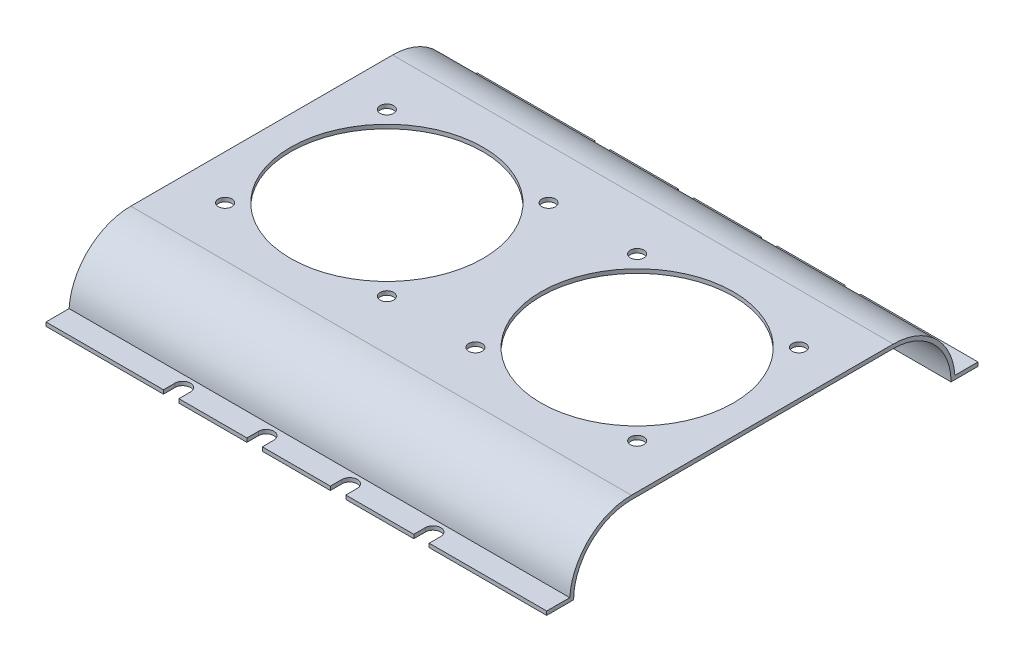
from build123d import *

# Parameters (mm, degrees)
AUFSATZ_LINEAR_AUSTRAGEN7_DEPTH  = 130
AUFSATZ_LINEAR_AUSTRAGEN8_DEPTH  = 130
AUFSATZ_LINEAR_AUSTRAGEN9_DEPTH  = 130
AUFSATZ_LINEAR_AUSTRAGEN10_DEPTH = 130
AUFSATZ_LINEAR_AUSTRAGEN11_DEPTH = 130
SKIZZE5_R                        = 25
SCHNITT_LINEAR_AUSTRAGEN1_DEPTH  = 12
SCHNITT_LINEAR_AUSTRAGEN2_DEPTH  = 2
SCHNITT_LINEAR_AUSTRAGEN4_DEPTH  = 2
SKIZZE9_R                        = 1.75
SCHNITT_LINEAR_AUSTRAGEN10_DEPTH = 2


with BuildPart() as part:
    # 3D-Skizze4 → Aufsatz-Linear austragen7 (new body)
    with BuildSketch(Plane(origin=(0, 1, 72.000262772), x_dir=(0, -0.16439898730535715, 0.9863939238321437), z_dir=(1, 0, 0))):
        Polygon((0, 0), (0.164398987, 0.986393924), (6.08276253, 0), (5.918363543, -0.986393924), align=None)
    extrude(amount=AUFSATZ_LINEAR_AUSTRAGEN7_DEPTH)

    # 3D-Skizze6 → Aufsatz-Linear austragen8 (add)
    with BuildSketch(Plane(origin=(0, 0, 72.031482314), x_dir=(0, 0.7071067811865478, -0.7071067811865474), z_dir=(-1, 0, 0))):
        with BuildLine():
            Line((0, 0), (0.729182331, 0.729182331))
            ThreePointArc((0.729182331, 0.729182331), (11.335784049, -3.664215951), (21.942385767, 0.729182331))
            Line((21.942385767, 0.729182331), (22.671568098, 0))
            ThreePointArc((22.671568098, 0), (11.335784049, -4.695435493), (0, 0))
        make_face()
    extrude(amount=-AUFSATZ_LINEAR_AUSTRAGEN8_DEPTH)

    # 3D-Skizze7 → Aufsatz-Linear austragen9 (add)
    with BuildSketch(Plane(origin=(0, 16.031219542, -11.999737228), x_dir=(0, -0.015163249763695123, 0.9998850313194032), z_dir=(1, 0, 0))):
        Polygon((0, 0), (0.015636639, 1.031100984), (68.007818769, 0), (67.99218213, -1.031100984), align=None)
    extrude(amount=AUFSATZ_LINEAR_AUSTRAGEN9_DEPTH)

    # 3D-Skizze8 → Aufsatz-Linear austragen10 (add)
    with BuildSketch(Plane(origin=(0, 0, -28.03095677), x_dir=(0, 0.7071067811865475, 0.7071067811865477), z_dir=(1, 0, 0))):
        with BuildLine():
            Line((0, 0), (0.736183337, 0.722185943))
            ThreePointArc((0.736183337, 0.722185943), (11.340732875, -3.664215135), (21.942385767, 0.729182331))
            Line((21.942385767, 0.729182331), (22.671568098, 0))
            ThreePointArc((22.671568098, 0), (11.335784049, -4.695435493), (0, 0))
        make_face()
    extrude(amount=AUFSATZ_LINEAR_AUSTRAGEN10_DEPTH)

    # 3D-Skizze9 → Aufsatz-Linear austragen11 (add)
    with BuildSketch(Plane(origin=(0, 1, -27.999737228), x_dir=(0, -0.16439898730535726, -0.9863939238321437), z_dir=(-1, 0, 0))):
        Polygon((0, 0), (0.164398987, 0.986393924), (6.08276253, 0), (5.918363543, -0.986393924), align=None)
    extrude(amount=-AUFSATZ_LINEAR_AUSTRAGEN11_DEPTH)

    # Skizze5 → Schnitt-Linear austragen1 (cut)
    with BuildSketch(Plane(origin=(0, 16.031219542, 0), x_dir=(1, 0, 0), z_dir=(0, 1, 0))):
        with Locations(Location((97.5, -22.000262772, 0), (0, 0, 270))):
            Circle(SKIZZE5_R)
        with Locations(Location((32.5, -22.000262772, 0), (0, 0, 270))):
            Circle(SKIZZE5_R)
    extrude(amount=-SCHNITT_LINEAR_AUSTRAGEN1_DEPTH, mode=Mode.SUBTRACT)

    # Skizze6 → Schnitt-Linear austragen2 (cut)
    with BuildSketch(Plane(origin=(0, 1, 0), x_dir=(1, 0, 0), z_dir=(0, 1, 0))):
        with BuildLine():
            Line((73.834, -75.000262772), (73.834, -78.000262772))
            Line((73.834, -78.000262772), (77.834, -78.000262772))
            Line((77.834, -78.000262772), (77.834, -75.000262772))
            ThreePointArc((77.834, -75.000262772), (75.834, -73.000262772), (73.834, -75.000262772))
        make_face()
        with BuildLine():
            Line((52.168, -75.000262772), (52.168, -78.000262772))
            Line((52.168, -78.000262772), (56.168, -78.000262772))
            Line((56.168, -78.000262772), (56.168, -75.000262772))
            ThreePointArc((56.168, -75.000262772), (54.168, -73.000262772), (52.168, -75.000262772))
        make_face()
        with BuildLine():
            Line((34.5, -75.000262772), (34.5, -78.000262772))
            Line((34.5, -78.000262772), (30.5, -78.000262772))
            Line((30.5, -78.000262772), (30.5, -75.000262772))
            ThreePointArc((30.5, -75.000262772), (32.5, -73.000262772), (34.5, -75.000262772))
        make_face()
        with BuildLine():
            Line((95.5, -75.000262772), (95.5, -78.000262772))
            Line((95.5, -78.000262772), (99.5, -78.000262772))
            Line((99.5, -78.000262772), (99.5, -75.000262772))
            ThreePointArc((99.5, -75.000262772), (97.5, -73.000262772), (95.5, -75.000262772))
        make_face()
    extrude(amount=-SCHNITT_LINEAR_AUSTRAGEN2_DEPTH, mode=Mode.SUBTRACT)

    # Skizze8 → Schnitt-Linear austragen4 (cut)
    with BuildSketch(Plane(origin=(0, 1, 0), x_dir=(1, 0, 0), z_dir=(0, 1, 0))):
        with BuildLine():
            Line((99.5, 30.999737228), (99.5, 33.999737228))
            Line((99.5, 33.999737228), (95.5, 33.999737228))
            Line((95.5, 33.999737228), (95.5, 30.999737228))
            ThreePointArc((95.5, 30.999737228), (97.5, 28.999737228), (99.5, 30.999737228))
        make_face()
        with BuildLine():
            Line((77.834, 30.999737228), (77.834, 33.999737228))
            Line((77.834, 33.999737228), (73.834, 33.999737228))
            Line((73.834, 33.999737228), (73.834, 30.999737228))
            ThreePointArc((73.834, 30.999737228), (75.834, 28.999737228), (77.834, 30.999737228))
        make_face()
        with BuildLine():
            Line((56.168, 30.999737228), (56.168, 33.999737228))
            Line((56.168, 33.999737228), (52.168, 33.999737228))
            Line((52.168, 33.999737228), (52.168, 30.999737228))
            ThreePointArc((52.168, 30.999737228), (54.168, 28.999737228), (56.168, 30.999737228))
        make_face()
        with BuildLine():
            Line((34.5, 30.999737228), (34.5, 33.999737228))
            Line((34.5, 33.999737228), (30.5, 33.999737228))
            Line((30.5, 33.999737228), (30.5, 30.999737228))
            ThreePointArc((30.5, 30.999737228), (32.5, 28.999737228), (34.5, 30.999737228))
        make_face()
    extrude(amount=-SCHNITT_LINEAR_AUSTRAGEN4_DEPTH, mode=Mode.SUBTRACT)

    # Skizze9 → Schnitt-Linear austragen10 (cut)
    with BuildSketch(Plane(origin=(0, 16.031219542, 0), x_dir=(1, 0, 0), z_dir=(0, 1, 0))):
        with Locations(Location((11.498928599, -0.99919137, 0), (0, 0, 270))):
            Circle(SKIZZE9_R)
        with Locations(Location((53.501071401, -0.99919137, 0), (0, 0, 270))):
            Circle(SKIZZE9_R)
        with Locations(Location((76.498928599, -0.99919137, 0), (0, 0, 270))):
            Circle(SKIZZE9_R)
        with Locations(Location((118.501071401, -0.99919137, 0), (0, 0, 270))):
            Circle(SKIZZE9_R)
        with Locations(Location((118.501071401, -43.001334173, 0), (0, 0, 270))):
            Circle(SKIZZE9_R)
        with Locations(Location((76.498928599, -43.001334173, 0), (0, 0, 270))):
            Circle(SKIZZE9_R)
        with Locations(Location((53.501071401, -43.001334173, 0), (0, 0, 270))):
            Circle(SKIZZE9_R)
        with Locations(Location((11.498928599, -43.001334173, 0), (0, 0, 270))):
            Circle(SKIZZE9_R)
    extrude(amount=-SCHNITT_LINEAR_AUSTRAGEN10_DEPTH, mode=Mode.SUBTRACT)


solid = part.part
